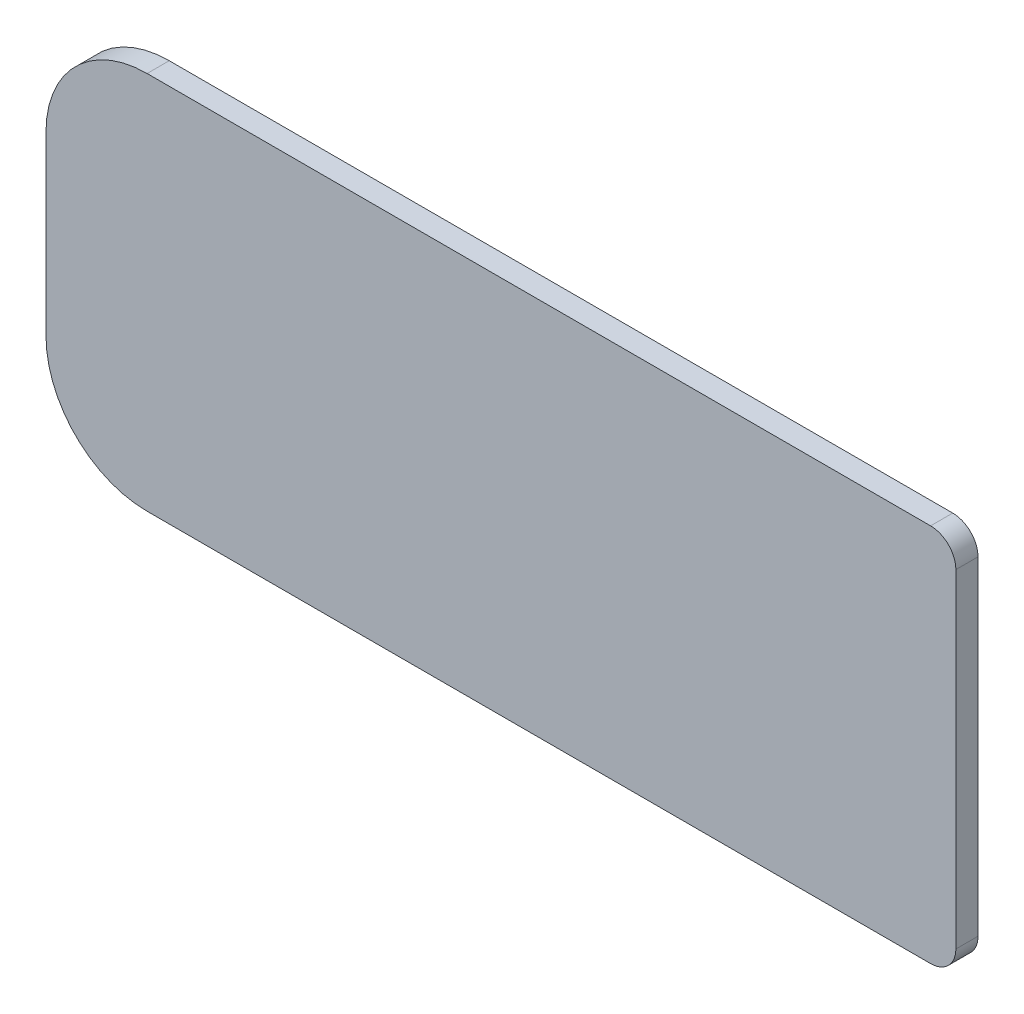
ISO-10303-21;
HEADER;
FILE_DESCRIPTION(('STEP AP214'),'2;1');
FILE_NAME('part.step','',(''),(''),'','','');
FILE_SCHEMA(('AUTOMOTIVE_DESIGN { 1 0 10303 214 1 1 1 1 }'));
ENDSEC;
DATA;
#1=APPLICATION_CONTEXT('core data for automotive mechanical design processes');
#2=APPLICATION_PROTOCOL_DEFINITION('international standard','automotive_design',2000,#1);
#3=PRODUCT_CONTEXT('',#1,'mechanical');
#4=PRODUCT('Part','Part','',(#3));
#5=PRODUCT_RELATED_PRODUCT_CATEGORY('part','',(#4));
#6=PRODUCT_DEFINITION_FORMATION('','',#4);
#7=PRODUCT_DEFINITION_CONTEXT('part definition',#1,'design');
#8=PRODUCT_DEFINITION('design','',#6,#7);
#9=PRODUCT_DEFINITION_SHAPE('','',#8);
#10=(LENGTH_UNIT() NAMED_UNIT(*) SI_UNIT(.MILLI.,.METRE.));
#11=(NAMED_UNIT(*) PLANE_ANGLE_UNIT() SI_UNIT($,.RADIAN.));
#12=(NAMED_UNIT(*) SI_UNIT($,.STERADIAN.) SOLID_ANGLE_UNIT());
#13=UNCERTAINTY_MEASURE_WITH_UNIT(LENGTH_MEASURE(1.E-05),#10,'distance_accuracy_value','');
#14=(GEOMETRIC_REPRESENTATION_CONTEXT(3) GLOBAL_UNCERTAINTY_ASSIGNED_CONTEXT((#13)) GLOBAL_UNIT_ASSIGNED_CONTEXT((#10,
#11,#12)) REPRESENTATION_CONTEXT('',''));
#15=CARTESIAN_POINT('',(0.,0.,0.));
#16=DIRECTION('',(0.,0.,1.));
#17=DIRECTION('',(1.,0.,0.));
#18=AXIS2_PLACEMENT_3D('',#15,#16,#17);
#19=CARTESIAN_POINT('',(0.,-95.25,11.1252));
#20=DIRECTION('',(0.,1.,0.));
#21=DIRECTION('',(0.,0.,1.));
#22=AXIS2_PLACEMENT_3D('',#19,#20,#21);
#23=PLANE('',#22);
#24=DIRECTION('',(1.,0.,0.));
#25=VECTOR('',#24,1.);
#26=CARTESIAN_POINT('',(0.,-95.25,0.));
#27=LINE('',#26,#25);
#28=CARTESIAN_POINT('',(50.8,-95.25,0.));
#29=VERTEX_POINT('',#28);
#30=CARTESIAN_POINT('',(444.5,-95.25,0.));
#31=VERTEX_POINT('',#30);
#32=EDGE_CURVE('E115',#29,#31,#27,.T.);
#33=ORIENTED_EDGE('',*,*,#32,.T.);
#34=DIRECTION('',(0.,0.,-1.));
#35=VECTOR('',#34,1.);
#36=CARTESIAN_POINT('',(444.5,-95.25,11.1252));
#37=LINE('',#36,#35);
#38=CARTESIAN_POINT('',(444.5,-95.25,11.1252));
#39=VERTEX_POINT('',#38);
#40=EDGE_CURVE('E11',#31,#39,#37,.F.);
#41=ORIENTED_EDGE('',*,*,#40,.T.);
#42=DIRECTION('',(1.,0.,0.));
#43=VECTOR('',#42,1.);
#44=CARTESIAN_POINT('',(0.,-95.25,11.1252));
#45=LINE('',#44,#43);
#46=CARTESIAN_POINT('',(50.8,-95.25,11.1252));
#47=VERTEX_POINT('',#46);
#48=EDGE_CURVE('E116',#47,#39,#45,.T.);
#49=ORIENTED_EDGE('',*,*,#48,.F.);
#50=DIRECTION('',(0.,0.,-1.));
#51=VECTOR('',#50,1.);
#52=CARTESIAN_POINT('',(50.8,-95.25,11.1252));
#53=LINE('',#52,#51);
#54=EDGE_CURVE('E106',#47,#29,#53,.T.);
#55=ORIENTED_EDGE('',*,*,#54,.T.);
#56=EDGE_LOOP('',(#33,#41,#49,#55));
#57=FACE_BOUND('',#56,.T.);
#58=ADVANCED_FACE('F35',(#57),#23,.F.);
#59=CARTESIAN_POINT('',(457.2,-95.25,11.1252));
#60=DIRECTION('',(-1.,0.,0.));
#61=DIRECTION('',(0.,0.,1.));
#62=AXIS2_PLACEMENT_3D('',#59,#60,#61);
#63=PLANE('',#62);
#64=DIRECTION('',(0.,1.,0.));
#65=VECTOR('',#64,1.);
#66=CARTESIAN_POINT('',(457.2,-95.25,0.));
#67=LINE('',#66,#65);
#68=CARTESIAN_POINT('',(457.2,-82.55,0.));
#69=VERTEX_POINT('',#68);
#70=CARTESIAN_POINT('',(457.2,82.55,0.));
#71=VERTEX_POINT('',#70);
#72=EDGE_CURVE('E123',#69,#71,#67,.T.);
#73=ORIENTED_EDGE('',*,*,#72,.T.);
#74=DIRECTION('',(0.,0.,-1.));
#75=VECTOR('',#74,1.);
#76=CARTESIAN_POINT('',(457.2,82.55,11.1252));
#77=LINE('',#76,#75);
#78=CARTESIAN_POINT('',(457.2,82.55,11.1252));
#79=VERTEX_POINT('',#78);
#80=EDGE_CURVE('E56',#71,#79,#77,.F.);
#81=ORIENTED_EDGE('',*,*,#80,.T.);
#82=DIRECTION('',(0.,1.,0.));
#83=VECTOR('',#82,1.);
#84=CARTESIAN_POINT('',(457.2,-95.25,11.1252));
#85=LINE('',#84,#83);
#86=CARTESIAN_POINT('',(457.2,-82.55,11.1252));
#87=VERTEX_POINT('',#86);
#88=EDGE_CURVE('E161',#87,#79,#85,.T.);
#89=ORIENTED_EDGE('',*,*,#88,.F.);
#90=DIRECTION('',(0.,0.,-1.));
#91=VECTOR('',#90,1.);
#92=CARTESIAN_POINT('',(457.2,-82.55,11.1252));
#93=LINE('',#92,#91);
#94=EDGE_CURVE('E152',#87,#69,#93,.T.);
#95=ORIENTED_EDGE('',*,*,#94,.T.);
#96=EDGE_LOOP('',(#73,#81,#89,#95));
#97=FACE_BOUND('',#96,.T.);
#98=ADVANCED_FACE('F169',(#97),#63,.F.);
#99=CARTESIAN_POINT('',(457.2,95.25,11.1252));
#100=DIRECTION('',(0.,-1.,0.));
#101=DIRECTION('',(1.,0.,0.));
#102=AXIS2_PLACEMENT_3D('',#99,#100,#101);
#103=PLANE('',#102);
#104=DIRECTION('',(-1.,0.,0.));
#105=VECTOR('',#104,1.);
#106=CARTESIAN_POINT('',(457.2,95.25,11.1252));
#107=LINE('',#106,#105);
#108=CARTESIAN_POINT('',(444.5,95.25,11.1252));
#109=VERTEX_POINT('',#108);
#110=CARTESIAN_POINT('',(50.8,95.25,11.1252));
#111=VERTEX_POINT('',#110);
#112=EDGE_CURVE('E117',#109,#111,#107,.T.);
#113=ORIENTED_EDGE('',*,*,#112,.F.);
#114=DIRECTION('',(0.,0.,-1.));
#115=VECTOR('',#114,1.);
#116=CARTESIAN_POINT('',(444.5,95.25,11.1252));
#117=LINE('',#116,#115);
#118=CARTESIAN_POINT('',(444.5,95.25,0.));
#119=VERTEX_POINT('',#118);
#120=EDGE_CURVE('E146',#109,#119,#117,.T.);
#121=ORIENTED_EDGE('',*,*,#120,.T.);
#122=DIRECTION('',(-1.,0.,0.));
#123=VECTOR('',#122,1.);
#124=CARTESIAN_POINT('',(457.2,95.25,0.));
#125=LINE('',#124,#123);
#126=CARTESIAN_POINT('',(50.8,95.25,0.));
#127=VERTEX_POINT('',#126);
#128=EDGE_CURVE('E125',#119,#127,#125,.T.);
#129=ORIENTED_EDGE('',*,*,#128,.T.);
#130=DIRECTION('',(0.,0.,-1.));
#131=VECTOR('',#130,1.);
#132=CARTESIAN_POINT('',(50.8,95.25,11.1252));
#133=LINE('',#132,#131);
#134=EDGE_CURVE('E143',#127,#111,#133,.F.);
#135=ORIENTED_EDGE('',*,*,#134,.T.);
#136=EDGE_LOOP('',(#113,#121,#129,#135));
#137=FACE_BOUND('',#136,.T.);
#138=ADVANCED_FACE('F165',(#137),#103,.F.);
#139=CARTESIAN_POINT('',(0.,0.,11.1252));
#140=DIRECTION('',(1.,0.,0.));
#141=DIRECTION('',(0.,0.,-1.));
#142=AXIS2_PLACEMENT_3D('',#139,#140,#141);
#143=PLANE('',#142);
#144=DIRECTION('',(0.,-1.,0.));
#145=VECTOR('',#144,1.);
#146=CARTESIAN_POINT('',(0.,0.,0.));
#147=LINE('',#146,#145);
#148=CARTESIAN_POINT('',(0.,44.45,0.));
#149=VERTEX_POINT('',#148);
#150=CARTESIAN_POINT('',(0.,-44.45,0.));
#151=VERTEX_POINT('',#150);
#152=EDGE_CURVE('E131',#149,#151,#147,.T.);
#153=ORIENTED_EDGE('',*,*,#152,.T.);
#154=DIRECTION('',(0.,0.,-1.));
#155=VECTOR('',#154,1.);
#156=CARTESIAN_POINT('',(0.,-44.45,11.1252));
#157=LINE('',#156,#155);
#158=CARTESIAN_POINT('',(0.,-44.45,11.1252));
#159=VERTEX_POINT('',#158);
#160=EDGE_CURVE('E107',#151,#159,#157,.F.);
#161=ORIENTED_EDGE('',*,*,#160,.T.);
#162=DIRECTION('',(0.,-1.,0.));
#163=VECTOR('',#162,1.);
#164=CARTESIAN_POINT('',(0.,-95.25,11.1252));
#165=LINE('',#164,#163);
#166=CARTESIAN_POINT('',(0.,44.4499999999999,11.1252));
#167=VERTEX_POINT('',#166);
#168=EDGE_CURVE('E132',#167,#159,#165,.T.);
#169=ORIENTED_EDGE('',*,*,#168,.F.);
#170=DIRECTION('',(0.,0.,-1.));
#171=VECTOR('',#170,1.);
#172=CARTESIAN_POINT('',(0.,44.45,11.1252));
#173=LINE('',#172,#171);
#174=EDGE_CURVE('E112',#167,#149,#173,.T.);
#175=ORIENTED_EDGE('',*,*,#174,.T.);
#176=EDGE_LOOP('',(#153,#161,#169,#175));
#177=FACE_BOUND('',#176,.T.);
#178=ADVANCED_FACE('F179',(#177),#143,.F.);
#179=CARTESIAN_POINT('',(0.,0.,11.1252));
#180=DIRECTION('',(0.,0.,1.));
#181=DIRECTION('',(1.,0.,0.));
#182=AXIS2_PLACEMENT_3D('',#179,#180,#181);
#183=PLANE('',#182);
#184=ORIENTED_EDGE('',*,*,#88,.T.);
#185=CARTESIAN_POINT('',(444.5,82.55,11.1252));
#186=DIRECTION('',(0.,0.,1.));
#187=DIRECTION('',(1.,0.,0.));
#188=AXIS2_PLACEMENT_3D('',#185,#186,#187);
#189=CIRCLE('',#188,12.7);
#190=EDGE_CURVE('E43',#79,#109,#189,.T.);
#191=ORIENTED_EDGE('',*,*,#190,.T.);
#192=ORIENTED_EDGE('',*,*,#112,.T.);
#193=CARTESIAN_POINT('',(50.8,44.45,11.1252));
#194=DIRECTION('',(0.,0.,1.));
#195=DIRECTION('',(1.,0.,0.));
#196=AXIS2_PLACEMENT_3D('',#193,#194,#195);
#197=CIRCLE('',#196,50.8);
#198=EDGE_CURVE('E139',#111,#167,#197,.T.);
#199=ORIENTED_EDGE('',*,*,#198,.T.);
#200=ORIENTED_EDGE('',*,*,#168,.T.);
#201=CARTESIAN_POINT('',(50.8,-44.45,11.1252));
#202=DIRECTION('',(0.,0.,1.));
#203=DIRECTION('',(1.,0.,0.));
#204=AXIS2_PLACEMENT_3D('',#201,#202,#203);
#205=CIRCLE('',#204,50.8);
#206=EDGE_CURVE('E141',#159,#47,#205,.T.);
#207=ORIENTED_EDGE('',*,*,#206,.T.);
#208=ORIENTED_EDGE('',*,*,#48,.T.);
#209=CARTESIAN_POINT('',(444.5,-82.55,11.1252));
#210=DIRECTION('',(0.,0.,1.));
#211=DIRECTION('',(1.,0.,0.));
#212=AXIS2_PLACEMENT_3D('',#209,#210,#211);
#213=CIRCLE('',#212,12.7);
#214=EDGE_CURVE('E156',#39,#87,#213,.T.);
#215=ORIENTED_EDGE('',*,*,#214,.T.);
#216=EDGE_LOOP('',(#184,#191,#192,#199,#200,#207,#208,#215));
#217=FACE_BOUND('',#216,.T.);
#218=ADVANCED_FACE('F160',(#217),#183,.T.);
#219=CARTESIAN_POINT('',(0.,0.,0.));
#220=DIRECTION('',(0.,0.,1.));
#221=DIRECTION('',(1.,0.,0.));
#222=AXIS2_PLACEMENT_3D('',#219,#220,#221);
#223=PLANE('',#222);
#224=ORIENTED_EDGE('',*,*,#128,.F.);
#225=CARTESIAN_POINT('',(444.5,82.55,0.));
#226=DIRECTION('',(0.,0.,1.));
#227=DIRECTION('',(1.,0.,0.));
#228=AXIS2_PLACEMENT_3D('',#225,#226,#227);
#229=CIRCLE('',#228,12.7);
#230=EDGE_CURVE('E150',#119,#71,#229,.F.);
#231=ORIENTED_EDGE('',*,*,#230,.T.);
#232=ORIENTED_EDGE('',*,*,#72,.F.);
#233=CARTESIAN_POINT('',(444.5,-82.55,0.));
#234=DIRECTION('',(0.,0.,1.));
#235=DIRECTION('',(1.,0.,0.));
#236=AXIS2_PLACEMENT_3D('',#233,#234,#235);
#237=CIRCLE('',#236,12.7);
#238=EDGE_CURVE('E122',#69,#31,#237,.F.);
#239=ORIENTED_EDGE('',*,*,#238,.T.);
#240=ORIENTED_EDGE('',*,*,#32,.F.);
#241=CARTESIAN_POINT('',(50.8,-44.45,0.));
#242=DIRECTION('',(0.,0.,1.));
#243=DIRECTION('',(1.,0.,0.));
#244=AXIS2_PLACEMENT_3D('',#241,#242,#243);
#245=CIRCLE('',#244,50.8);
#246=EDGE_CURVE('E102',#29,#151,#245,.F.);
#247=ORIENTED_EDGE('',*,*,#246,.T.);
#248=ORIENTED_EDGE('',*,*,#152,.F.);
#249=CARTESIAN_POINT('',(50.8,44.45,0.));
#250=DIRECTION('',(0.,0.,1.));
#251=DIRECTION('',(1.,0.,0.));
#252=AXIS2_PLACEMENT_3D('',#249,#250,#251);
#253=CIRCLE('',#252,50.8);
#254=EDGE_CURVE('E113',#149,#127,#253,.F.);
#255=ORIENTED_EDGE('',*,*,#254,.T.);
#256=EDGE_LOOP('',(#224,#231,#232,#239,#240,#247,#248,#255));
#257=FACE_BOUND('',#256,.T.);
#258=ADVANCED_FACE('F120',(#257),#223,.F.);
#259=CARTESIAN_POINT('',(50.8,-44.45,11.1252));
#260=DIRECTION('',(0.,0.,-1.));
#261=DIRECTION('',(-1.,0.,0.));
#262=AXIS2_PLACEMENT_3D('',#259,#260,#261);
#263=CYLINDRICAL_SURFACE('',#262,50.8);
#264=ORIENTED_EDGE('',*,*,#206,.F.);
#265=ORIENTED_EDGE('',*,*,#160,.F.);
#266=ORIENTED_EDGE('',*,*,#246,.F.);
#267=ORIENTED_EDGE('',*,*,#54,.F.);
#268=EDGE_LOOP('',(#264,#265,#266,#267));
#269=FACE_BOUND('',#268,.T.);
#270=ADVANCED_FACE('F105',(#269),#263,.T.);
#271=CARTESIAN_POINT('',(50.8,44.45,11.1252));
#272=DIRECTION('',(0.,0.,-1.));
#273=DIRECTION('',(-1.,0.,0.));
#274=AXIS2_PLACEMENT_3D('',#271,#272,#273);
#275=CYLINDRICAL_SURFACE('',#274,50.8);
#276=ORIENTED_EDGE('',*,*,#198,.F.);
#277=ORIENTED_EDGE('',*,*,#134,.F.);
#278=ORIENTED_EDGE('',*,*,#254,.F.);
#279=ORIENTED_EDGE('',*,*,#174,.F.);
#280=EDGE_LOOP('',(#276,#277,#278,#279));
#281=FACE_BOUND('',#280,.T.);
#282=ADVANCED_FACE('F181',(#281),#275,.T.);
#283=CARTESIAN_POINT('',(444.5,82.55,11.1252));
#284=DIRECTION('',(0.,0.,-1.));
#285=DIRECTION('',(-1.,0.,0.));
#286=AXIS2_PLACEMENT_3D('',#283,#284,#285);
#287=CYLINDRICAL_SURFACE('',#286,12.7);
#288=ORIENTED_EDGE('',*,*,#190,.F.);
#289=ORIENTED_EDGE('',*,*,#80,.F.);
#290=ORIENTED_EDGE('',*,*,#230,.F.);
#291=ORIENTED_EDGE('',*,*,#120,.F.);
#292=EDGE_LOOP('',(#288,#289,#290,#291));
#293=FACE_BOUND('',#292,.T.);
#294=ADVANCED_FACE('F168',(#293),#287,.T.);
#295=CARTESIAN_POINT('',(444.5,-82.55,11.1252));
#296=DIRECTION('',(0.,0.,-1.));
#297=DIRECTION('',(-1.,0.,0.));
#298=AXIS2_PLACEMENT_3D('',#295,#296,#297);
#299=CYLINDRICAL_SURFACE('',#298,12.7);
#300=ORIENTED_EDGE('',*,*,#214,.F.);
#301=ORIENTED_EDGE('',*,*,#40,.F.);
#302=ORIENTED_EDGE('',*,*,#238,.F.);
#303=ORIENTED_EDGE('',*,*,#94,.F.);
#304=EDGE_LOOP('',(#300,#301,#302,#303));
#305=FACE_BOUND('',#304,.T.);
#306=ADVANCED_FACE('F37',(#305),#299,.T.);
#307=CLOSED_SHELL('',(#58,#98,#138,#178,#218,#258,#270,#282,#294,#306));
#308=MANIFOLD_SOLID_BREP('B2',#307);
#309=ADVANCED_BREP_SHAPE_REPRESENTATION('',(#18,#308),#14);
#310=SHAPE_DEFINITION_REPRESENTATION(#9,#309);
ENDSEC;
END-ISO-10303-21;
